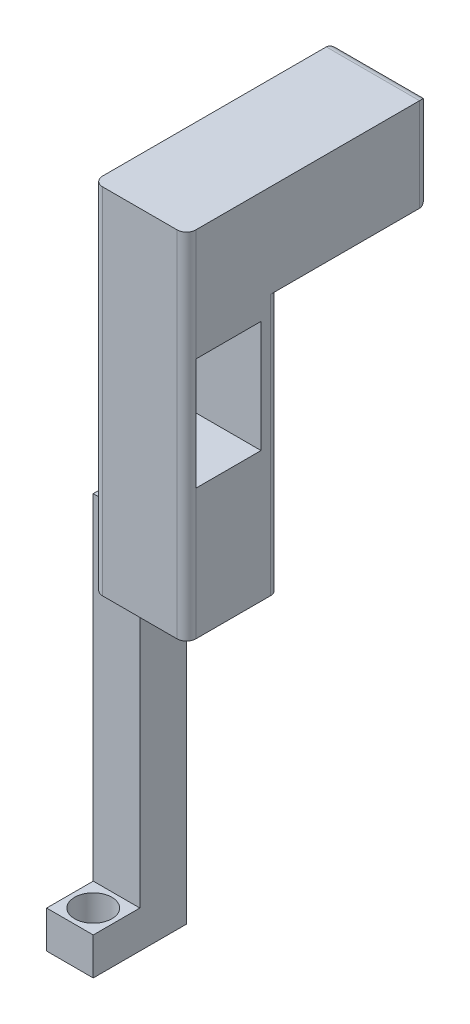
ISO-10303-21;
HEADER;
FILE_DESCRIPTION(('STEP AP214'),'2;1');
FILE_NAME('part.step','',(''),(''),'','','');
FILE_SCHEMA(('AUTOMOTIVE_DESIGN { 1 0 10303 214 1 1 1 1 }'));
ENDSEC;
DATA;
#1=APPLICATION_CONTEXT('core data for automotive mechanical design processes');
#2=APPLICATION_PROTOCOL_DEFINITION('international standard','automotive_design',2000,#1);
#3=PRODUCT_CONTEXT('',#1,'mechanical');
#4=PRODUCT('Part','Part','',(#3));
#5=PRODUCT_RELATED_PRODUCT_CATEGORY('part','',(#4));
#6=PRODUCT_DEFINITION_FORMATION('','',#4);
#7=PRODUCT_DEFINITION_CONTEXT('part definition',#1,'design');
#8=PRODUCT_DEFINITION('design','',#6,#7);
#9=PRODUCT_DEFINITION_SHAPE('','',#8);
#10=(LENGTH_UNIT() NAMED_UNIT(*) SI_UNIT(.MILLI.,.METRE.));
#11=(NAMED_UNIT(*) PLANE_ANGLE_UNIT() SI_UNIT($,.RADIAN.));
#12=(NAMED_UNIT(*) SI_UNIT($,.STERADIAN.) SOLID_ANGLE_UNIT());
#13=UNCERTAINTY_MEASURE_WITH_UNIT(LENGTH_MEASURE(1.E-05),#10,'distance_accuracy_value','');
#14=(GEOMETRIC_REPRESENTATION_CONTEXT(3) GLOBAL_UNCERTAINTY_ASSIGNED_CONTEXT((#13)) GLOBAL_UNIT_ASSIGNED_CONTEXT((#10,
#11,#12)) REPRESENTATION_CONTEXT('',''));
#15=CARTESIAN_POINT('',(0.,0.,0.));
#16=DIRECTION('',(0.,0.,1.));
#17=DIRECTION('',(1.,0.,0.));
#18=AXIS2_PLACEMENT_3D('',#15,#16,#17);
#19=CARTESIAN_POINT('',(-3.75,2.,-2.5));
#20=DIRECTION('',(1.,0.,0.));
#21=DIRECTION('',(0.,0.,-1.));
#22=AXIS2_PLACEMENT_3D('',#19,#20,#21);
#23=PLANE('',#22);
#24=DIRECTION('',(0.,0.,-1.));
#25=VECTOR('',#24,1.);
#26=CARTESIAN_POINT('',(-3.75,-16.,0.));
#27=LINE('',#26,#25);
#28=CARTESIAN_POINT('',(-3.75,-16.,2.5));
#29=VERTEX_POINT('',#28);
#30=CARTESIAN_POINT('',(-3.75,-16.,0.));
#31=VERTEX_POINT('',#30);
#32=EDGE_CURVE('E266',#29,#31,#27,.T.);
#33=ORIENTED_EDGE('',*,*,#32,.T.);
#34=DIRECTION('',(0.,-1.,0.));
#35=VECTOR('',#34,1.);
#36=CARTESIAN_POINT('',(-3.75,0.,0.));
#37=LINE('',#36,#35);
#38=CARTESIAN_POINT('',(-3.75,2.,0.));
#39=VERTEX_POINT('',#38);
#40=EDGE_CURVE('E260',#39,#31,#37,.T.);
#41=ORIENTED_EDGE('',*,*,#40,.F.);
#42=DIRECTION('',(0.,0.,1.));
#43=VECTOR('',#42,1.);
#44=CARTESIAN_POINT('',(-3.75,2.,-2.5));
#45=LINE('',#44,#43);
#46=CARTESIAN_POINT('',(-3.75,2.,-2.5));
#47=VERTEX_POINT('',#46);
#48=EDGE_CURVE('E342',#47,#39,#45,.T.);
#49=ORIENTED_EDGE('',*,*,#48,.F.);
#50=DIRECTION('',(0.,-1.,0.));
#51=VECTOR('',#50,1.);
#52=CARTESIAN_POINT('',(-3.75,2.,-2.5));
#53=LINE('',#52,#51);
#54=CARTESIAN_POINT('',(-3.75,-18.,-2.5));
#55=VERTEX_POINT('',#54);
#56=EDGE_CURVE('E359',#47,#55,#53,.T.);
#57=ORIENTED_EDGE('',*,*,#56,.T.);
#58=DIRECTION('',(0.,0.,-1.));
#59=VECTOR('',#58,1.);
#60=CARTESIAN_POINT('',(-3.75,-18.,0.));
#61=LINE('',#60,#59);
#62=CARTESIAN_POINT('',(-3.75,-18.,2.5));
#63=VERTEX_POINT('',#62);
#64=EDGE_CURVE('E296',#63,#55,#61,.T.);
#65=ORIENTED_EDGE('',*,*,#64,.F.);
#66=DIRECTION('',(0.,-1.,0.));
#67=VECTOR('',#66,1.);
#68=CARTESIAN_POINT('',(-3.75,2.,2.5));
#69=LINE('',#68,#67);
#70=EDGE_CURVE('E347',#29,#63,#69,.T.);
#71=ORIENTED_EDGE('',*,*,#70,.F.);
#72=EDGE_LOOP('',(#33,#41,#49,#57,#65,#71));
#73=FACE_BOUND('',#72,.T.);
#74=ADVANCED_FACE('F45',(#73),#23,.F.);
#75=CARTESIAN_POINT('',(-3.75,2.,2.5));
#76=DIRECTION('',(0.,0.,-1.));
#77=DIRECTION('',(-1.,0.,0.));
#78=AXIS2_PLACEMENT_3D('',#75,#76,#77);
#79=PLANE('',#78);
#80=DIRECTION('',(-1.,0.,0.));
#81=VECTOR('',#80,1.);
#82=CARTESIAN_POINT('',(-1.25,-16.,2.5));
#83=LINE('',#82,#81);
#84=CARTESIAN_POINT('',(-1.25,-16.,2.5));
#85=VERTEX_POINT('',#84);
#86=EDGE_CURVE('E277',#85,#29,#83,.T.);
#87=ORIENTED_EDGE('',*,*,#86,.T.);
#88=ORIENTED_EDGE('',*,*,#70,.T.);
#89=DIRECTION('',(-1.,0.,0.));
#90=VECTOR('',#89,1.);
#91=CARTESIAN_POINT('',(0.,-18.,2.5));
#92=LINE('',#91,#90);
#93=CARTESIAN_POINT('',(-1.25,-18.,2.5));
#94=VERTEX_POINT('',#93);
#95=EDGE_CURVE('E291',#94,#63,#92,.T.);
#96=ORIENTED_EDGE('',*,*,#95,.F.);
#97=DIRECTION('',(0.,1.,0.));
#98=VECTOR('',#97,1.);
#99=CARTESIAN_POINT('',(-1.25,-18.,2.5));
#100=LINE('',#99,#98);
#101=EDGE_CURVE('E309',#94,#85,#100,.T.);
#102=ORIENTED_EDGE('',*,*,#101,.T.);
#103=EDGE_LOOP('',(#87,#88,#96,#102));
#104=FACE_BOUND('',#103,.T.);
#105=ADVANCED_FACE('F504',(#104),#79,.F.);
#106=DIRECTION('',(1.,0.,0.));
#107=VECTOR('',#106,1.);
#108=CARTESIAN_POINT('',(-3.75,0.,2.5));
#109=LINE('',#108,#107);
#110=CARTESIAN_POINT('',(-0.75,0.,2.5));
#111=VERTEX_POINT('',#110);
#112=CARTESIAN_POINT('',(3.25,0.,2.5));
#113=VERTEX_POINT('',#112);
#114=EDGE_CURVE('E343',#111,#113,#109,.T.);
#115=ORIENTED_EDGE('',*,*,#114,.T.);
#116=DIRECTION('',(0.,-1.,0.));
#117=VECTOR('',#116,1.);
#118=CARTESIAN_POINT('',(3.25,2.,2.5));
#119=LINE('',#118,#117);
#120=CARTESIAN_POINT('',(3.25,19.,2.5));
#121=VERTEX_POINT('',#120);
#122=EDGE_CURVE('E434',#113,#121,#119,.F.);
#123=ORIENTED_EDGE('',*,*,#122,.T.);
#124=DIRECTION('',(1.,0.,0.));
#125=VECTOR('',#124,1.);
#126=CARTESIAN_POINT('',(0.,19.,2.5));
#127=LINE('',#126,#125);
#128=CARTESIAN_POINT('',(-0.75,19.,2.5));
#129=VERTEX_POINT('',#128);
#130=EDGE_CURVE('E328',#129,#121,#127,.T.);
#131=ORIENTED_EDGE('',*,*,#130,.F.);
#132=DIRECTION('',(0.,-1.,0.));
#133=VECTOR('',#132,1.);
#134=CARTESIAN_POINT('',(-0.75,2.,2.5));
#135=LINE('',#134,#133);
#136=EDGE_CURVE('E430',#129,#111,#135,.T.);
#137=ORIENTED_EDGE('',*,*,#136,.T.);
#138=EDGE_LOOP('',(#115,#123,#131,#137));
#139=FACE_BOUND('',#138,.T.);
#140=ADVANCED_FACE('F531',(#139),#79,.F.);
#141=CARTESIAN_POINT('',(-1.25,-18.,0.));
#142=DIRECTION('',(1.,0.,0.));
#143=DIRECTION('',(0.,0.,-1.));
#144=AXIS2_PLACEMENT_3D('',#141,#142,#143);
#145=PLANE('',#144);
#146=DIRECTION('',(0.,1.,0.));
#147=VECTOR('',#146,1.);
#148=CARTESIAN_POINT('',(-1.25,-18.,0.));
#149=LINE('',#148,#147);
#150=CARTESIAN_POINT('',(-1.25,-16.,0.));
#151=VERTEX_POINT('',#150);
#152=CARTESIAN_POINT('',(-1.25,0.,0.));
#153=VERTEX_POINT('',#152);
#154=EDGE_CURVE('E362',#151,#153,#149,.T.);
#155=ORIENTED_EDGE('',*,*,#154,.F.);
#156=DIRECTION('',(0.,0.,-1.));
#157=VECTOR('',#156,1.);
#158=CARTESIAN_POINT('',(-1.25,-16.,0.));
#159=LINE('',#158,#157);
#160=EDGE_CURVE('E265',#85,#151,#159,.T.);
#161=ORIENTED_EDGE('',*,*,#160,.F.);
#162=ORIENTED_EDGE('',*,*,#101,.F.);
#163=DIRECTION('',(0.,0.,-1.));
#164=VECTOR('',#163,1.);
#165=CARTESIAN_POINT('',(-1.25,-18.,0.));
#166=LINE('',#165,#164);
#167=CARTESIAN_POINT('',(-1.25,-18.,-2.5));
#168=VERTEX_POINT('',#167);
#169=EDGE_CURVE('E287',#94,#168,#166,.T.);
#170=ORIENTED_EDGE('',*,*,#169,.T.);
#171=DIRECTION('',(0.,1.,0.));
#172=VECTOR('',#171,1.);
#173=CARTESIAN_POINT('',(-1.25,-18.,-2.5));
#174=LINE('',#173,#172);
#175=CARTESIAN_POINT('',(-1.25,0.,-2.5));
#176=VERTEX_POINT('',#175);
#177=EDGE_CURVE('E303',#168,#176,#174,.T.);
#178=ORIENTED_EDGE('',*,*,#177,.T.);
#179=DIRECTION('',(0.,0.,-1.));
#180=VECTOR('',#179,1.);
#181=CARTESIAN_POINT('',(-1.25,0.,0.));
#182=LINE('',#181,#180);
#183=EDGE_CURVE('E281',#153,#176,#182,.T.);
#184=ORIENTED_EDGE('',*,*,#183,.F.);
#185=EDGE_LOOP('',(#155,#161,#162,#170,#178,#184));
#186=FACE_BOUND('',#185,.T.);
#187=ADVANCED_FACE('F509',(#186),#145,.T.);
#188=CARTESIAN_POINT('',(-3.75,2.,-2.5));
#189=DIRECTION('',(0.,0.,1.));
#190=DIRECTION('',(1.,0.,0.));
#191=AXIS2_PLACEMENT_3D('',#188,#189,#190);
#192=PLANE('',#191);
#193=DIRECTION('',(-1.,0.,0.));
#194=VECTOR('',#193,1.);
#195=CARTESIAN_POINT('',(0.,14.,-2.5));
#196=LINE('',#195,#194);
#197=CARTESIAN_POINT('',(3.25,14.,-2.5));
#198=VERTEX_POINT('',#197);
#199=CARTESIAN_POINT('',(-0.750000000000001,14.,-2.5));
#200=VERTEX_POINT('',#199);
#201=EDGE_CURVE('E313',#198,#200,#196,.T.);
#202=ORIENTED_EDGE('',*,*,#201,.F.);
#203=DIRECTION('',(0.,-1.,0.));
#204=VECTOR('',#203,1.);
#205=CARTESIAN_POINT('',(3.25,2.,-2.5));
#206=LINE('',#205,#204);
#207=CARTESIAN_POINT('',(3.25,0.,-2.5));
#208=VERTEX_POINT('',#207);
#209=EDGE_CURVE('E417',#198,#208,#206,.T.);
#210=ORIENTED_EDGE('',*,*,#209,.T.);
#211=DIRECTION('',(-1.,0.,0.));
#212=VECTOR('',#211,1.);
#213=CARTESIAN_POINT('',(-3.75,0.,-2.5));
#214=LINE('',#213,#212);
#215=EDGE_CURVE('E351',#208,#176,#214,.T.);
#216=ORIENTED_EDGE('',*,*,#215,.T.);
#217=ORIENTED_EDGE('',*,*,#177,.F.);
#218=DIRECTION('',(1.,0.,0.));
#219=VECTOR('',#218,1.);
#220=CARTESIAN_POINT('',(0.,-18.,-2.5));
#221=LINE('',#220,#219);
#222=EDGE_CURVE('E300',#55,#168,#221,.T.);
#223=ORIENTED_EDGE('',*,*,#222,.F.);
#224=ORIENTED_EDGE('',*,*,#56,.F.);
#225=DIRECTION('',(-1.,0.,0.));
#226=VECTOR('',#225,1.);
#227=CARTESIAN_POINT('',(-3.75,2.,-2.5));
#228=LINE('',#227,#226);
#229=CARTESIAN_POINT('',(-0.750000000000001,2.,-2.5));
#230=VERTEX_POINT('',#229);
#231=EDGE_CURVE('E339',#230,#47,#228,.T.);
#232=ORIENTED_EDGE('',*,*,#231,.F.);
#233=DIRECTION('',(0.,-1.,0.));
#234=VECTOR('',#233,1.);
#235=CARTESIAN_POINT('',(-0.750000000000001,2.,-2.5));
#236=LINE('',#235,#234);
#237=EDGE_CURVE('E414',#230,#200,#236,.F.);
#238=ORIENTED_EDGE('',*,*,#237,.T.);
#239=EDGE_LOOP('',(#202,#210,#216,#217,#223,#224,#232,#238));
#240=FACE_BOUND('',#239,.T.);
#241=ADVANCED_FACE('F479',(#240),#192,.F.);
#242=CARTESIAN_POINT('',(3.75,2.,-2.5));
#243=DIRECTION('',(-1.,0.,0.));
#244=DIRECTION('',(0.,0.,1.));
#245=AXIS2_PLACEMENT_3D('',#242,#243,#244);
#246=PLANE('',#245);
#247=DIRECTION('',(0.,-1.,0.));
#248=VECTOR('',#247,1.);
#249=CARTESIAN_POINT('',(3.75,2.,2.));
#250=LINE('',#249,#248);
#251=CARTESIAN_POINT('',(3.75,19.,2.));
#252=VERTEX_POINT('',#251);
#253=CARTESIAN_POINT('',(3.75,13.,2.));
#254=VERTEX_POINT('',#253);
#255=EDGE_CURVE('E223',#252,#254,#250,.T.);
#256=ORIENTED_EDGE('',*,*,#255,.T.);
#257=DIRECTION('',(0.,0.,-1.));
#258=VECTOR('',#257,1.);
#259=CARTESIAN_POINT('',(3.75,13.,0.));
#260=LINE('',#259,#258);
#261=CARTESIAN_POINT('',(3.75,13.,-1.5));
#262=VERTEX_POINT('',#261);
#263=EDGE_CURVE('E63',#254,#262,#260,.T.);
#264=ORIENTED_EDGE('',*,*,#263,.T.);
#265=DIRECTION('',(0.,-1.,0.));
#266=VECTOR('',#265,1.);
#267=CARTESIAN_POINT('',(3.75,0.,-1.5));
#268=LINE('',#267,#266);
#269=CARTESIAN_POINT('',(3.75,7.,-1.5));
#270=VERTEX_POINT('',#269);
#271=EDGE_CURVE('E212',#262,#270,#268,.T.);
#272=ORIENTED_EDGE('',*,*,#271,.T.);
#273=DIRECTION('',(0.,0.,-1.));
#274=VECTOR('',#273,1.);
#275=CARTESIAN_POINT('',(3.75,7.,0.));
#276=LINE('',#275,#274);
#277=CARTESIAN_POINT('',(3.75,7.,2.));
#278=VERTEX_POINT('',#277);
#279=EDGE_CURVE('E217',#278,#270,#276,.T.);
#280=ORIENTED_EDGE('',*,*,#279,.F.);
#281=CARTESIAN_POINT('',(3.75,0.,2.));
#282=VERTEX_POINT('',#281);
#283=EDGE_CURVE('E404',#278,#282,#250,.T.);
#284=ORIENTED_EDGE('',*,*,#283,.T.);
#285=DIRECTION('',(0.,0.,-1.));
#286=VECTOR('',#285,1.);
#287=CARTESIAN_POINT('',(3.75,0.,-2.5));
#288=LINE('',#287,#286);
#289=CARTESIAN_POINT('',(3.75,0.,-2.));
#290=VERTEX_POINT('',#289);
#291=EDGE_CURVE('E336',#282,#290,#288,.T.);
#292=ORIENTED_EDGE('',*,*,#291,.T.);
#293=DIRECTION('',(0.,-1.,0.));
#294=VECTOR('',#293,1.);
#295=CARTESIAN_POINT('',(3.75,2.,-2.));
#296=LINE('',#295,#294);
#297=CARTESIAN_POINT('',(3.75,14.,-2.));
#298=VERTEX_POINT('',#297);
#299=EDGE_CURVE('E407',#290,#298,#296,.F.);
#300=ORIENTED_EDGE('',*,*,#299,.T.);
#301=DIRECTION('',(0.,0.,1.));
#302=VECTOR('',#301,1.);
#303=CARTESIAN_POINT('',(3.75,14.,-10.5));
#304=LINE('',#303,#302);
#305=CARTESIAN_POINT('',(3.75,14.,-10.));
#306=VERTEX_POINT('',#305);
#307=EDGE_CURVE('E320',#306,#298,#304,.T.);
#308=ORIENTED_EDGE('',*,*,#307,.F.);
#309=DIRECTION('',(0.,-1.,0.));
#310=VECTOR('',#309,1.);
#311=CARTESIAN_POINT('',(3.75,19.,-10.));
#312=LINE('',#311,#310);
#313=CARTESIAN_POINT('',(3.75,19.,-10.));
#314=VERTEX_POINT('',#313);
#315=EDGE_CURVE('E411',#306,#314,#312,.F.);
#316=ORIENTED_EDGE('',*,*,#315,.T.);
#317=DIRECTION('',(0.,0.,-1.));
#318=VECTOR('',#317,1.);
#319=CARTESIAN_POINT('',(3.75,19.,0.));
#320=LINE('',#319,#318);
#321=EDGE_CURVE('E332',#252,#314,#320,.T.);
#322=ORIENTED_EDGE('',*,*,#321,.F.);
#323=EDGE_LOOP('',(#256,#264,#272,#280,#284,#292,#300,#308,#316,#322));
#324=FACE_BOUND('',#323,.T.);
#325=ADVANCED_FACE('F220',(#324),#246,.F.);
#326=CARTESIAN_POINT('',(0.,2.,0.));
#327=DIRECTION('',(0.,1.,0.));
#328=DIRECTION('',(0.,0.,1.));
#329=AXIS2_PLACEMENT_3D('',#326,#327,#328);
#330=PLANE('',#329);
#331=DIRECTION('',(-1.,0.,0.));
#332=VECTOR('',#331,1.);
#333=CARTESIAN_POINT('',(-1.25,2.,0.));
#334=LINE('',#333,#332);
#335=CARTESIAN_POINT('',(-1.25,2.,0.));
#336=VERTEX_POINT('',#335);
#337=EDGE_CURVE('E270',#336,#39,#334,.T.);
#338=ORIENTED_EDGE('',*,*,#337,.F.);
#339=DIRECTION('',(0.,0.,1.));
#340=VECTOR('',#339,1.);
#341=CARTESIAN_POINT('',(-1.25,2.,0.));
#342=LINE('',#341,#340);
#343=CARTESIAN_POINT('',(-1.25,2.,-2.));
#344=VERTEX_POINT('',#343);
#345=EDGE_CURVE('E323',#344,#336,#342,.T.);
#346=ORIENTED_EDGE('',*,*,#345,.F.);
#347=CARTESIAN_POINT('',(-0.750000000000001,2.,-2.));
#348=DIRECTION('',(0.,1.,0.));
#349=DIRECTION('',(0.,0.,1.));
#350=AXIS2_PLACEMENT_3D('',#347,#348,#349);
#351=CIRCLE('',#350,0.5);
#352=EDGE_CURVE('E55',#344,#230,#351,.F.);
#353=ORIENTED_EDGE('',*,*,#352,.T.);
#354=ORIENTED_EDGE('',*,*,#231,.T.);
#355=ORIENTED_EDGE('',*,*,#48,.T.);
#356=EDGE_LOOP('',(#338,#346,#353,#354,#355));
#357=FACE_BOUND('',#356,.T.);
#358=ADVANCED_FACE('F492',(#357),#330,.T.);
#359=CARTESIAN_POINT('',(0.,0.,0.));
#360=DIRECTION('',(0.,1.,0.));
#361=DIRECTION('',(0.,0.,1.));
#362=AXIS2_PLACEMENT_3D('',#359,#360,#361);
#363=PLANE('',#362);
#364=ORIENTED_EDGE('',*,*,#215,.F.);
#365=CARTESIAN_POINT('',(3.25,0.,-2.));
#366=DIRECTION('',(0.,1.,0.));
#367=DIRECTION('',(0.,0.,1.));
#368=AXIS2_PLACEMENT_3D('',#365,#366,#367);
#369=CIRCLE('',#368,0.5);
#370=EDGE_CURVE('E427',#208,#290,#369,.F.);
#371=ORIENTED_EDGE('',*,*,#370,.T.);
#372=ORIENTED_EDGE('',*,*,#291,.F.);
#373=CARTESIAN_POINT('',(3.25,0.,2.));
#374=DIRECTION('',(0.,1.,0.));
#375=DIRECTION('',(0.,0.,1.));
#376=AXIS2_PLACEMENT_3D('',#373,#374,#375);
#377=CIRCLE('',#376,0.5);
#378=EDGE_CURVE('E424',#282,#113,#377,.F.);
#379=ORIENTED_EDGE('',*,*,#378,.T.);
#380=ORIENTED_EDGE('',*,*,#114,.F.);
#381=CARTESIAN_POINT('',(-0.75,0.,2.));
#382=DIRECTION('',(0.,1.,0.));
#383=DIRECTION('',(0.,0.,1.));
#384=AXIS2_PLACEMENT_3D('',#381,#382,#383);
#385=CIRCLE('',#384,0.5);
#386=CARTESIAN_POINT('',(-1.25,0.,2.));
#387=VERTEX_POINT('',#386);
#388=EDGE_CURVE('E421',#111,#387,#385,.F.);
#389=ORIENTED_EDGE('',*,*,#388,.T.);
#390=EDGE_CURVE('E292',#387,#153,#182,.T.);
#391=ORIENTED_EDGE('',*,*,#390,.T.);
#392=ORIENTED_EDGE('',*,*,#183,.T.);
#393=EDGE_LOOP('',(#364,#371,#372,#379,#380,#389,#391,#392));
#394=FACE_BOUND('',#393,.T.);
#395=ADVANCED_FACE('F533',(#394),#363,.F.);
#396=CARTESIAN_POINT('',(-1.25,19.,0.));
#397=DIRECTION('',(1.,0.,0.));
#398=DIRECTION('',(0.,0.,-1.));
#399=AXIS2_PLACEMENT_3D('',#396,#397,#398);
#400=PLANE('',#399);
#401=DIRECTION('',(0.,-1.,0.));
#402=VECTOR('',#401,1.);
#403=CARTESIAN_POINT('',(-1.25,0.,-1.5));
#404=LINE('',#403,#402);
#405=CARTESIAN_POINT('',(-1.25,13.,-1.5));
#406=VERTEX_POINT('',#405);
#407=CARTESIAN_POINT('',(-1.25,7.,-1.5));
#408=VERTEX_POINT('',#407);
#409=EDGE_CURVE('E238',#406,#408,#404,.T.);
#410=ORIENTED_EDGE('',*,*,#409,.F.);
#411=DIRECTION('',(0.,0.,-1.));
#412=VECTOR('',#411,1.);
#413=CARTESIAN_POINT('',(-1.25,13.,0.));
#414=LINE('',#413,#412);
#415=CARTESIAN_POINT('',(-1.25,13.,2.));
#416=VERTEX_POINT('',#415);
#417=EDGE_CURVE('E202',#416,#406,#414,.T.);
#418=ORIENTED_EDGE('',*,*,#417,.F.);
#419=DIRECTION('',(0.,-1.,0.));
#420=VECTOR('',#419,1.);
#421=CARTESIAN_POINT('',(-1.25,19.,2.));
#422=LINE('',#421,#420);
#423=CARTESIAN_POINT('',(-1.25,19.,2.));
#424=VERTEX_POINT('',#423);
#425=EDGE_CURVE('E389',#416,#424,#422,.F.);
#426=ORIENTED_EDGE('',*,*,#425,.T.);
#427=DIRECTION('',(0.,0.,1.));
#428=VECTOR('',#427,1.);
#429=CARTESIAN_POINT('',(-1.25,19.,0.));
#430=LINE('',#429,#428);
#431=CARTESIAN_POINT('',(-1.25,19.,-10.));
#432=VERTEX_POINT('',#431);
#433=EDGE_CURVE('E324',#432,#424,#430,.T.);
#434=ORIENTED_EDGE('',*,*,#433,.F.);
#435=DIRECTION('',(0.,1.,0.));
#436=VECTOR('',#435,1.);
#437=CARTESIAN_POINT('',(-1.25,14.,-10.));
#438=LINE('',#437,#436);
#439=CARTESIAN_POINT('',(-1.25,14.,-10.));
#440=VERTEX_POINT('',#439);
#441=EDGE_CURVE('E398',#432,#440,#438,.F.);
#442=ORIENTED_EDGE('',*,*,#441,.T.);
#443=DIRECTION('',(0.,0.,1.));
#444=VECTOR('',#443,1.);
#445=CARTESIAN_POINT('',(-1.25,14.,-10.5));
#446=LINE('',#445,#444);
#447=CARTESIAN_POINT('',(-1.25,14.,-2.));
#448=VERTEX_POINT('',#447);
#449=EDGE_CURVE('E317',#440,#448,#446,.T.);
#450=ORIENTED_EDGE('',*,*,#449,.T.);
#451=DIRECTION('',(0.,-1.,0.));
#452=VECTOR('',#451,1.);
#453=CARTESIAN_POINT('',(-1.25,19.,-2.));
#454=LINE('',#453,#452);
#455=EDGE_CURVE('E394',#448,#344,#454,.T.);
#456=ORIENTED_EDGE('',*,*,#455,.T.);
#457=ORIENTED_EDGE('',*,*,#345,.T.);
#458=DIRECTION('',(0.,-1.,0.));
#459=VECTOR('',#458,1.);
#460=CARTESIAN_POINT('',(-1.25,0.,0.));
#461=LINE('',#460,#459);
#462=EDGE_CURVE('E261',#336,#153,#461,.T.);
#463=ORIENTED_EDGE('',*,*,#462,.T.);
#464=ORIENTED_EDGE('',*,*,#390,.F.);
#465=CARTESIAN_POINT('',(-1.25,7.,2.));
#466=VERTEX_POINT('',#465);
#467=EDGE_CURVE('E390',#387,#466,#422,.F.);
#468=ORIENTED_EDGE('',*,*,#467,.T.);
#469=DIRECTION('',(0.,0.,-1.));
#470=VECTOR('',#469,1.);
#471=CARTESIAN_POINT('',(-1.25,7.,0.));
#472=LINE('',#471,#470);
#473=EDGE_CURVE('E71',#466,#408,#472,.T.);
#474=ORIENTED_EDGE('',*,*,#473,.T.);
#475=EDGE_LOOP('',(#410,#418,#426,#434,#442,#450,#456,#457,#463,#464,#468,#474));
#476=FACE_BOUND('',#475,.T.);
#477=ADVANCED_FACE('F488',(#476),#400,.F.);
#478=CARTESIAN_POINT('',(0.,19.,0.));
#479=DIRECTION('',(0.,1.,0.));
#480=DIRECTION('',(0.,0.,1.));
#481=AXIS2_PLACEMENT_3D('',#478,#479,#480);
#482=PLANE('',#481);
#483=ORIENTED_EDGE('',*,*,#321,.T.);
#484=DIRECTION('',(1.,0.,0.));
#485=VECTOR('',#484,1.);
#486=CARTESIAN_POINT('',(0.,19.,-10.));
#487=LINE('',#486,#485);
#488=EDGE_CURVE('E385',#314,#432,#487,.F.);
#489=ORIENTED_EDGE('',*,*,#488,.T.);
#490=ORIENTED_EDGE('',*,*,#433,.T.);
#491=CARTESIAN_POINT('',(-0.75,19.,2.));
#492=DIRECTION('',(0.,1.,0.));
#493=DIRECTION('',(0.,0.,1.));
#494=AXIS2_PLACEMENT_3D('',#491,#492,#493);
#495=CIRCLE('',#494,0.5);
#496=EDGE_CURVE('E379',#424,#129,#495,.T.);
#497=ORIENTED_EDGE('',*,*,#496,.T.);
#498=ORIENTED_EDGE('',*,*,#130,.T.);
#499=CARTESIAN_POINT('',(3.25,19.,2.));
#500=DIRECTION('',(0.,1.,0.));
#501=DIRECTION('',(0.,0.,1.));
#502=AXIS2_PLACEMENT_3D('',#499,#500,#501);
#503=CIRCLE('',#502,0.5);
#504=EDGE_CURVE('E382',#121,#252,#503,.T.);
#505=ORIENTED_EDGE('',*,*,#504,.T.);
#506=EDGE_LOOP('',(#483,#489,#490,#497,#498,#505));
#507=FACE_BOUND('',#506,.T.);
#508=ADVANCED_FACE('F526',(#507),#482,.T.);
#509=CARTESIAN_POINT('',(0.,14.,-10.5));
#510=DIRECTION('',(0.,1.,0.));
#511=DIRECTION('',(0.,0.,1.));
#512=AXIS2_PLACEMENT_3D('',#509,#510,#511);
#513=PLANE('',#512);
#514=ORIENTED_EDGE('',*,*,#449,.F.);
#515=DIRECTION('',(-1.,0.,0.));
#516=VECTOR('',#515,1.);
#517=CARTESIAN_POINT('',(3.75,14.,-10.));
#518=LINE('',#517,#516);
#519=EDGE_CURVE('E401',#440,#306,#518,.F.);
#520=ORIENTED_EDGE('',*,*,#519,.T.);
#521=ORIENTED_EDGE('',*,*,#307,.T.);
#522=CARTESIAN_POINT('',(3.25,14.,-2.));
#523=DIRECTION('',(0.,1.,0.));
#524=DIRECTION('',(0.,0.,1.));
#525=AXIS2_PLACEMENT_3D('',#522,#523,#524);
#526=CIRCLE('',#525,0.5);
#527=EDGE_CURVE('E437',#298,#198,#526,.T.);
#528=ORIENTED_EDGE('',*,*,#527,.T.);
#529=ORIENTED_EDGE('',*,*,#201,.T.);
#530=CARTESIAN_POINT('',(-0.750000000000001,14.,-2.));
#531=DIRECTION('',(0.,1.,0.));
#532=DIRECTION('',(0.,0.,1.));
#533=AXIS2_PLACEMENT_3D('',#530,#531,#532);
#534=CIRCLE('',#533,0.5);
#535=EDGE_CURVE('E11',#200,#448,#534,.T.);
#536=ORIENTED_EDGE('',*,*,#535,.T.);
#537=EDGE_LOOP('',(#514,#520,#521,#528,#529,#536));
#538=FACE_BOUND('',#537,.T.);
#539=ADVANCED_FACE('F469',(#538),#513,.F.);
#540=CARTESIAN_POINT('',(0.,0.,-10.5));
#541=DIRECTION('',(0.,0.,-1.));
#542=DIRECTION('',(-1.,0.,0.));
#543=AXIS2_PLACEMENT_3D('',#540,#541,#542);
#544=PLANE('',#543);
#545=DIRECTION('',(0.,1.,0.));
#546=VECTOR('',#545,1.);
#547=CARTESIAN_POINT('',(-0.750000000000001,19.,-10.5));
#548=LINE('',#547,#546);
#549=CARTESIAN_POINT('',(-0.750000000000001,14.5,-10.5));
#550=VERTEX_POINT('',#549);
#551=CARTESIAN_POINT('',(-0.750000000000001,18.5,-10.5));
#552=VERTEX_POINT('',#551);
#553=EDGE_CURVE('E372',#550,#552,#548,.T.);
#554=ORIENTED_EDGE('',*,*,#553,.T.);
#555=DIRECTION('',(1.,0.,0.));
#556=VECTOR('',#555,1.);
#557=CARTESIAN_POINT('',(0.,18.5,-10.5));
#558=LINE('',#557,#556);
#559=CARTESIAN_POINT('',(3.25,18.5,-10.5));
#560=VERTEX_POINT('',#559);
#561=EDGE_CURVE('E375',#552,#560,#558,.T.);
#562=ORIENTED_EDGE('',*,*,#561,.T.);
#563=DIRECTION('',(0.,-1.,0.));
#564=VECTOR('',#563,1.);
#565=CARTESIAN_POINT('',(3.25,14.,-10.5));
#566=LINE('',#565,#564);
#567=CARTESIAN_POINT('',(3.25,14.5,-10.5));
#568=VERTEX_POINT('',#567);
#569=EDGE_CURVE('E366',#560,#568,#566,.T.);
#570=ORIENTED_EDGE('',*,*,#569,.T.);
#571=DIRECTION('',(-1.,0.,0.));
#572=VECTOR('',#571,1.);
#573=CARTESIAN_POINT('',(-1.25,14.5,-10.5));
#574=LINE('',#573,#572);
#575=EDGE_CURVE('E369',#568,#550,#574,.T.);
#576=ORIENTED_EDGE('',*,*,#575,.T.);
#577=EDGE_LOOP('',(#554,#562,#570,#576));
#578=FACE_BOUND('',#577,.T.);
#579=ADVANCED_FACE('F597',(#578),#544,.T.);
#580=CARTESIAN_POINT('',(0.,-18.,0.));
#581=DIRECTION('',(0.,-1.,0.));
#582=DIRECTION('',(0.,0.,-1.));
#583=AXIS2_PLACEMENT_3D('',#580,#581,#582);
#584=PLANE('',#583);
#585=CARTESIAN_POINT('',(-2.5,-18.,1.25));
#586=DIRECTION('',(0.,-1.,0.));
#587=DIRECTION('',(0.,0.,-1.));
#588=AXIS2_PLACEMENT_3D('',#585,#586,#587);
#589=CIRCLE('',#588,1.);
#590=CARTESIAN_POINT('',(-2.5,-18.,0.250000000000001));
#591=VERTEX_POINT('',#590);
#592=EDGE_CURVE('E256',#591,#591,#589,.T.);
#593=ORIENTED_EDGE('',*,*,#592,.F.);
#594=EDGE_LOOP('',(#593));
#595=FACE_BOUND('',#594,.T.);
#596=ORIENTED_EDGE('',*,*,#169,.F.);
#597=ORIENTED_EDGE('',*,*,#95,.T.);
#598=ORIENTED_EDGE('',*,*,#64,.T.);
#599=ORIENTED_EDGE('',*,*,#222,.T.);
#600=EDGE_LOOP('',(#596,#597,#598,#599));
#601=FACE_BOUND('',#600,.T.);
#602=ADVANCED_FACE('F591',(#595,#601),#584,.T.);
#603=CARTESIAN_POINT('',(-1.25,-16.,0.));
#604=DIRECTION('',(0.,1.,0.));
#605=DIRECTION('',(0.,0.,1.));
#606=AXIS2_PLACEMENT_3D('',#603,#604,#605);
#607=PLANE('',#606);
#608=CARTESIAN_POINT('',(-2.5,-16.,1.25));
#609=DIRECTION('',(0.,1.,0.));
#610=DIRECTION('',(0.,0.,1.));
#611=AXIS2_PLACEMENT_3D('',#608,#609,#610);
#612=CIRCLE('',#611,1.);
#613=CARTESIAN_POINT('',(-2.5,-16.,2.25));
#614=VERTEX_POINT('',#613);
#615=EDGE_CURVE('E252',#614,#614,#612,.T.);
#616=ORIENTED_EDGE('',*,*,#615,.F.);
#617=EDGE_LOOP('',(#616));
#618=FACE_BOUND('',#617,.T.);
#619=ORIENTED_EDGE('',*,*,#32,.F.);
#620=ORIENTED_EDGE('',*,*,#86,.F.);
#621=ORIENTED_EDGE('',*,*,#160,.T.);
#622=DIRECTION('',(-1.,0.,0.));
#623=VECTOR('',#622,1.);
#624=CARTESIAN_POINT('',(-1.25,-16.,0.));
#625=LINE('',#624,#623);
#626=EDGE_CURVE('E282',#151,#31,#625,.T.);
#627=ORIENTED_EDGE('',*,*,#626,.T.);
#628=EDGE_LOOP('',(#619,#620,#621,#627));
#629=FACE_BOUND('',#628,.T.);
#630=ADVANCED_FACE('F501',(#618,#629),#607,.T.);
#631=CARTESIAN_POINT('',(-1.25,0.,0.));
#632=DIRECTION('',(0.,0.,-1.));
#633=DIRECTION('',(0.,1.,0.));
#634=AXIS2_PLACEMENT_3D('',#631,#632,#633);
#635=PLANE('',#634);
#636=ORIENTED_EDGE('',*,*,#40,.T.);
#637=ORIENTED_EDGE('',*,*,#626,.F.);
#638=ORIENTED_EDGE('',*,*,#154,.T.);
#639=ORIENTED_EDGE('',*,*,#462,.F.);
#640=ORIENTED_EDGE('',*,*,#337,.T.);
#641=EDGE_LOOP('',(#636,#637,#638,#639,#640));
#642=FACE_BOUND('',#641,.T.);
#643=ADVANCED_FACE('F496',(#642),#635,.F.);
#644=CARTESIAN_POINT('',(-2.5,-18.5,1.25));
#645=DIRECTION('',(0.,1.,0.));
#646=DIRECTION('',(0.,0.,1.));
#647=AXIS2_PLACEMENT_3D('',#644,#645,#646);
#648=CYLINDRICAL_SURFACE('',#647,1.);
#649=ORIENTED_EDGE('',*,*,#592,.T.);
#650=EDGE_LOOP('',(#649));
#651=FACE_BOUND('',#650,.T.);
#652=ORIENTED_EDGE('',*,*,#615,.T.);
#653=EDGE_LOOP('',(#652));
#654=FACE_BOUND('',#653,.T.);
#655=ADVANCED_FACE('F571',(#651,#654),#648,.F.);
#656=CARTESIAN_POINT('',(0.,14.5,-10.));
#657=DIRECTION('',(1.,0.,0.));
#658=DIRECTION('',(0.,0.,-1.));
#659=AXIS2_PLACEMENT_3D('',#656,#657,#658);
#660=CYLINDRICAL_SURFACE('',#659,0.5);
#661=CARTESIAN_POINT('',(3.25,14.5,-10.));
#662=DIRECTION('',(0.707106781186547,0.707106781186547,0.));
#663=DIRECTION('',(-0.707106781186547,0.707106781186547,0.));
#664=AXIS2_PLACEMENT_3D('',#661,#662,#663);
#665=ELLIPSE('',#664,0.707106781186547,0.5);
#666=EDGE_CURVE('E447',#306,#568,#665,.T.);
#667=ORIENTED_EDGE('',*,*,#666,.F.);
#668=ORIENTED_EDGE('',*,*,#519,.F.);
#669=CARTESIAN_POINT('',(-0.750000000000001,14.5,-10.));
#670=DIRECTION('',(0.707106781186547,-0.707106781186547,0.));
#671=DIRECTION('',(0.707106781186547,0.707106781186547,0.));
#672=AXIS2_PLACEMENT_3D('',#669,#670,#671);
#673=ELLIPSE('',#672,0.707106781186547,0.5);
#674=EDGE_CURVE('E49',#550,#440,#673,.F.);
#675=ORIENTED_EDGE('',*,*,#674,.F.);
#676=ORIENTED_EDGE('',*,*,#575,.F.);
#677=EDGE_LOOP('',(#667,#668,#675,#676));
#678=FACE_BOUND('',#677,.T.);
#679=ADVANCED_FACE('F465',(#678),#660,.T.);
#680=CARTESIAN_POINT('',(-0.750000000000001,0.,-10.));
#681=DIRECTION('',(0.,-1.,0.));
#682=DIRECTION('',(0.,0.,-1.));
#683=AXIS2_PLACEMENT_3D('',#680,#681,#682);
#684=CYLINDRICAL_SURFACE('',#683,0.5);
#685=ORIENTED_EDGE('',*,*,#674,.T.);
#686=ORIENTED_EDGE('',*,*,#441,.F.);
#687=CARTESIAN_POINT('',(-0.750000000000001,18.5,-10.));
#688=DIRECTION('',(-0.707106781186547,-0.707106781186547,0.));
#689=DIRECTION('',(0.707106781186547,-0.707106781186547,0.));
#690=AXIS2_PLACEMENT_3D('',#687,#688,#689);
#691=ELLIPSE('',#690,0.707106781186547,0.5);
#692=EDGE_CURVE('E445',#552,#432,#691,.F.);
#693=ORIENTED_EDGE('',*,*,#692,.F.);
#694=ORIENTED_EDGE('',*,*,#553,.F.);
#695=EDGE_LOOP('',(#685,#686,#693,#694));
#696=FACE_BOUND('',#695,.T.);
#697=ADVANCED_FACE('F460',(#696),#684,.T.);
#698=CARTESIAN_POINT('',(3.25,0.,-10.));
#699=DIRECTION('',(0.,1.,0.));
#700=DIRECTION('',(0.,0.,1.));
#701=AXIS2_PLACEMENT_3D('',#698,#699,#700);
#702=CYLINDRICAL_SURFACE('',#701,0.5);
#703=ORIENTED_EDGE('',*,*,#666,.T.);
#704=ORIENTED_EDGE('',*,*,#569,.F.);
#705=CARTESIAN_POINT('',(3.25,18.5,-10.));
#706=DIRECTION('',(-0.707106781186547,0.707106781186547,0.));
#707=DIRECTION('',(0.707106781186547,0.707106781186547,0.));
#708=AXIS2_PLACEMENT_3D('',#705,#706,#707);
#709=ELLIPSE('',#708,0.707106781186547,0.5);
#710=EDGE_CURVE('E246',#314,#560,#709,.T.);
#711=ORIENTED_EDGE('',*,*,#710,.F.);
#712=ORIENTED_EDGE('',*,*,#315,.F.);
#713=EDGE_LOOP('',(#703,#704,#711,#712));
#714=FACE_BOUND('',#713,.T.);
#715=ADVANCED_FACE('F563',(#714),#702,.T.);
#716=CARTESIAN_POINT('',(0.,18.5,-10.));
#717=DIRECTION('',(1.,0.,0.));
#718=DIRECTION('',(0.,0.,-1.));
#719=AXIS2_PLACEMENT_3D('',#716,#717,#718);
#720=CYLINDRICAL_SURFACE('',#719,0.5);
#721=ORIENTED_EDGE('',*,*,#692,.T.);
#722=ORIENTED_EDGE('',*,*,#488,.F.);
#723=ORIENTED_EDGE('',*,*,#710,.T.);
#724=ORIENTED_EDGE('',*,*,#561,.F.);
#725=EDGE_LOOP('',(#721,#722,#723,#724));
#726=FACE_BOUND('',#725,.T.);
#727=ADVANCED_FACE('F560',(#726),#720,.T.);
#728=CARTESIAN_POINT('',(3.25,2.,-2.));
#729=DIRECTION('',(0.,-1.,0.));
#730=DIRECTION('',(0.,0.,-1.));
#731=AXIS2_PLACEMENT_3D('',#728,#729,#730);
#732=CYLINDRICAL_SURFACE('',#731,0.5);
#733=ORIENTED_EDGE('',*,*,#527,.F.);
#734=ORIENTED_EDGE('',*,*,#299,.F.);
#735=ORIENTED_EDGE('',*,*,#370,.F.);
#736=ORIENTED_EDGE('',*,*,#209,.F.);
#737=EDGE_LOOP('',(#733,#734,#735,#736));
#738=FACE_BOUND('',#737,.T.);
#739=ADVANCED_FACE('F475',(#738),#732,.T.);
#740=CARTESIAN_POINT('',(3.25,2.,2.));
#741=DIRECTION('',(0.,-1.,0.));
#742=DIRECTION('',(0.,0.,-1.));
#743=AXIS2_PLACEMENT_3D('',#740,#741,#742);
#744=CYLINDRICAL_SURFACE('',#743,0.5);
#745=ORIENTED_EDGE('',*,*,#504,.F.);
#746=ORIENTED_EDGE('',*,*,#122,.F.);
#747=ORIENTED_EDGE('',*,*,#378,.F.);
#748=ORIENTED_EDGE('',*,*,#283,.F.);
#749=DIRECTION('',(0.,1.,0.));
#750=VECTOR('',#749,1.);
#751=CARTESIAN_POINT('',(3.75,0.,2.));
#752=LINE('',#751,#750);
#753=EDGE_CURVE('E208',#278,#254,#752,.T.);
#754=ORIENTED_EDGE('',*,*,#753,.T.);
#755=ORIENTED_EDGE('',*,*,#255,.F.);
#756=EDGE_LOOP('',(#745,#746,#747,#748,#754,#755));
#757=FACE_BOUND('',#756,.T.);
#758=ADVANCED_FACE('F538',(#757),#744,.T.);
#759=CARTESIAN_POINT('',(-0.750000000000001,19.,-2.));
#760=DIRECTION('',(0.,-1.,0.));
#761=DIRECTION('',(0.,0.,-1.));
#762=AXIS2_PLACEMENT_3D('',#759,#760,#761);
#763=CYLINDRICAL_SURFACE('',#762,0.5);
#764=ORIENTED_EDGE('',*,*,#535,.F.);
#765=ORIENTED_EDGE('',*,*,#237,.F.);
#766=ORIENTED_EDGE('',*,*,#352,.F.);
#767=ORIENTED_EDGE('',*,*,#455,.F.);
#768=EDGE_LOOP('',(#764,#765,#766,#767));
#769=FACE_BOUND('',#768,.T.);
#770=ADVANCED_FACE('F484',(#769),#763,.T.);
#771=CARTESIAN_POINT('',(-0.75,2.,2.));
#772=DIRECTION('',(0.,-1.,0.));
#773=DIRECTION('',(0.,0.,-1.));
#774=AXIS2_PLACEMENT_3D('',#771,#772,#773);
#775=CYLINDRICAL_SURFACE('',#774,0.5);
#776=ORIENTED_EDGE('',*,*,#496,.F.);
#777=ORIENTED_EDGE('',*,*,#425,.F.);
#778=DIRECTION('',(0.,1.,0.));
#779=VECTOR('',#778,1.);
#780=CARTESIAN_POINT('',(-1.25,0.,2.));
#781=LINE('',#780,#779);
#782=EDGE_CURVE('E225',#466,#416,#781,.T.);
#783=ORIENTED_EDGE('',*,*,#782,.F.);
#784=ORIENTED_EDGE('',*,*,#467,.F.);
#785=ORIENTED_EDGE('',*,*,#388,.F.);
#786=ORIENTED_EDGE('',*,*,#136,.F.);
#787=EDGE_LOOP('',(#776,#777,#783,#784,#785,#786));
#788=FACE_BOUND('',#787,.T.);
#789=ADVANCED_FACE('F47',(#788),#775,.T.);
#790=CARTESIAN_POINT('',(3.75,13.,0.));
#791=DIRECTION('',(0.,1.,0.));
#792=DIRECTION('',(0.,0.,1.));
#793=AXIS2_PLACEMENT_3D('',#790,#791,#792);
#794=PLANE('',#793);
#795=ORIENTED_EDGE('',*,*,#417,.T.);
#796=DIRECTION('',(-1.,0.,0.));
#797=VECTOR('',#796,1.);
#798=CARTESIAN_POINT('',(3.75,13.,-1.5));
#799=LINE('',#798,#797);
#800=EDGE_CURVE('E198',#262,#406,#799,.T.);
#801=ORIENTED_EDGE('',*,*,#800,.F.);
#802=ORIENTED_EDGE('',*,*,#263,.F.);
#803=DIRECTION('',(-1.,0.,0.));
#804=VECTOR('',#803,1.);
#805=CARTESIAN_POINT('',(3.75,13.,2.));
#806=LINE('',#805,#804);
#807=EDGE_CURVE('E243',#254,#416,#806,.T.);
#808=ORIENTED_EDGE('',*,*,#807,.T.);
#809=EDGE_LOOP('',(#795,#801,#802,#808));
#810=FACE_BOUND('',#809,.T.);
#811=ADVANCED_FACE('F200',(#810),#794,.F.);
#812=CARTESIAN_POINT('',(3.75,0.,2.));
#813=DIRECTION('',(0.,0.,1.));
#814=DIRECTION('',(1.,0.,0.));
#815=AXIS2_PLACEMENT_3D('',#812,#813,#814);
#816=PLANE('',#815);
#817=ORIENTED_EDGE('',*,*,#782,.T.);
#818=ORIENTED_EDGE('',*,*,#807,.F.);
#819=ORIENTED_EDGE('',*,*,#753,.F.);
#820=DIRECTION('',(-1.,0.,0.));
#821=VECTOR('',#820,1.);
#822=CARTESIAN_POINT('',(3.75,7.,2.));
#823=LINE('',#822,#821);
#824=EDGE_CURVE('E247',#278,#466,#823,.T.);
#825=ORIENTED_EDGE('',*,*,#824,.T.);
#826=EDGE_LOOP('',(#817,#818,#819,#825));
#827=FACE_BOUND('',#826,.T.);
#828=ADVANCED_FACE('F521',(#827),#816,.F.);
#829=CARTESIAN_POINT('',(3.75,7.,0.));
#830=DIRECTION('',(0.,1.,0.));
#831=DIRECTION('',(0.,0.,1.));
#832=AXIS2_PLACEMENT_3D('',#829,#830,#831);
#833=PLANE('',#832);
#834=ORIENTED_EDGE('',*,*,#473,.F.);
#835=ORIENTED_EDGE('',*,*,#824,.F.);
#836=ORIENTED_EDGE('',*,*,#279,.T.);
#837=DIRECTION('',(-1.,0.,0.));
#838=VECTOR('',#837,1.);
#839=CARTESIAN_POINT('',(3.75,7.,-1.5));
#840=LINE('',#839,#838);
#841=EDGE_CURVE('E207',#270,#408,#840,.T.);
#842=ORIENTED_EDGE('',*,*,#841,.T.);
#843=EDGE_LOOP('',(#834,#835,#836,#842));
#844=FACE_BOUND('',#843,.T.);
#845=ADVANCED_FACE('F539',(#844),#833,.T.);
#846=CARTESIAN_POINT('',(3.75,0.,-1.5));
#847=DIRECTION('',(0.,0.,-1.));
#848=DIRECTION('',(0.,1.,0.));
#849=AXIS2_PLACEMENT_3D('',#846,#847,#848);
#850=PLANE('',#849);
#851=ORIENTED_EDGE('',*,*,#409,.T.);
#852=ORIENTED_EDGE('',*,*,#841,.F.);
#853=ORIENTED_EDGE('',*,*,#271,.F.);
#854=ORIENTED_EDGE('',*,*,#800,.T.);
#855=EDGE_LOOP('',(#851,#852,#853,#854));
#856=FACE_BOUND('',#855,.T.);
#857=ADVANCED_FACE('F213',(#856),#850,.F.);
#858=CLOSED_SHELL('',(#74,#105,#140,#187,#241,#325,#358,#395,#477,#508,#539,#579,#602,#630,#643,
#655,#679,#697,#715,#727,#739,#758,#770,#789,#811,#828,#845,#857));
#859=MANIFOLD_SOLID_BREP('B2',#858);
#860=ADVANCED_BREP_SHAPE_REPRESENTATION('',(#18,#859),#14);
#861=SHAPE_DEFINITION_REPRESENTATION(#9,#860);
ENDSEC;
END-ISO-10303-21;
